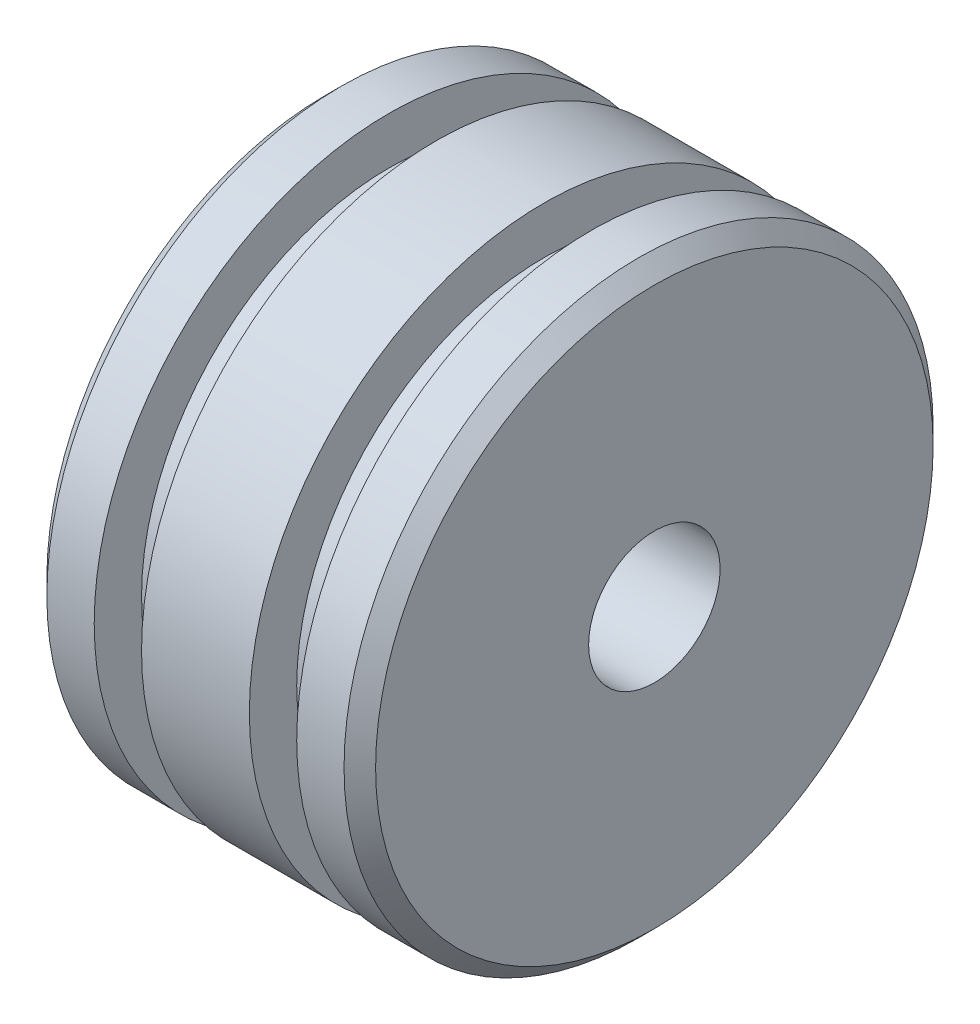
from build123d import *

# Parameters (mm, degrees)
SKETCH3_R          = 14.224
BASE_EXTRUDE_DEPTH = 15.875
SKETCH4_W          = 2.286
SKETCH4_H          = 2.286
SKETCH5_R          = 3.175
CUT_EXTRUDE1_DEPTH = 26.625377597
CHAMFER1_SIZE      = 0.762


with BuildPart() as part:
    # Sketch3 → Base-Extrude (new body)
    with BuildSketch(Plane(origin=(0, 0, 0), x_dir=(0, 0, -1), z_dir=(1, 0, 0))):
        Circle(SKETCH3_R)
    extrude(amount=BASE_EXTRUDE_DEPTH)

    # Sketch4 → Cut-Revolve1 (revolve, cut)
    with BuildSketch(Plane.XY, mode=Mode.PRIVATE) as cut_revolve1_sk:
        with Locations((4.191, 13.081)):
            Rectangle(SKETCH4_W, SKETCH4_H)
        with Locations((11.684, 13.081)):
            Rectangle(SKETCH4_W, SKETCH4_H)
    revolve(cut_revolve1_sk.sketch.rotate(Axis((0, 0, 0), (1, 0, 0)), 90), axis=Axis((0, 0, 0), (1, 0, 0)), mode=Mode.SUBTRACT)

    # Sketch5 → Cut-Extrude1 (cut, through all)
    with BuildSketch(Plane.ZY):
        Circle(SKETCH5_R)
    extrude(amount=-CUT_EXTRUDE1_DEPTH, mode=Mode.SUBTRACT)

    # Chamfer1
    chamfer1_edges = [part.edges().sort_by_distance(p)[0] for p in [
        (0, 0, 14.224),
        (15.875, 0, 14.224),
    ]]
    chamfer(chamfer1_edges, length=CHAMFER1_SIZE)


solid = part.part
